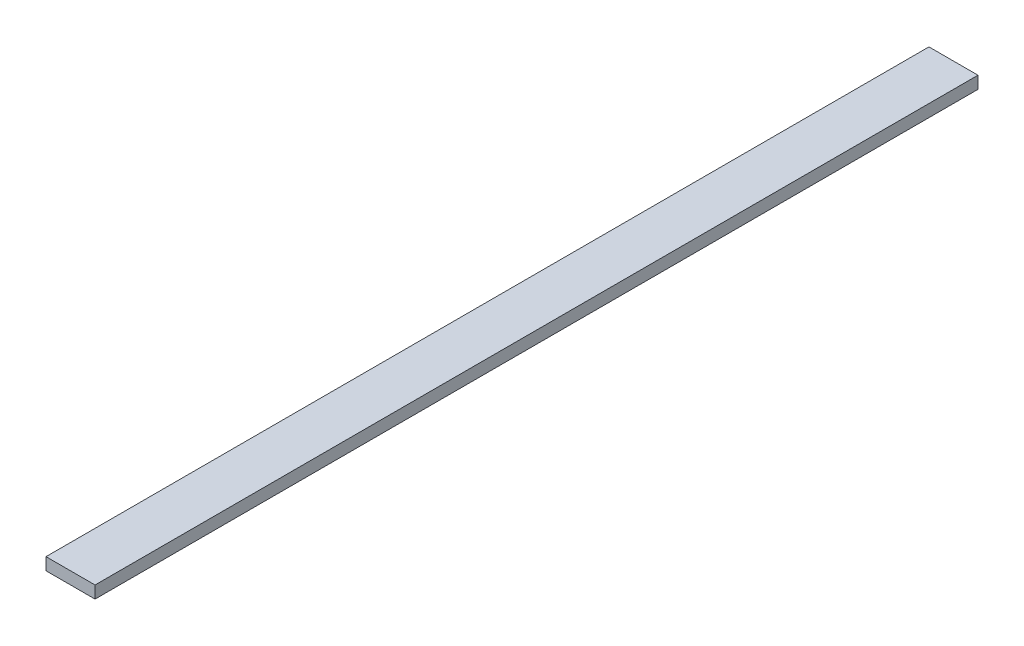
from build123d import *

# Parameters (mm, degrees)
SKETCH1_W           = 50.8
SKETCH1_H           = 12.7
BOSS_EXTRUDE1_DEPTH = 914.4


with BuildPart() as part:
    # Sketch1 → Boss-Extrude1 (new body)
    with BuildSketch(Plane.XY):
        Rectangle(SKETCH1_W, SKETCH1_H)
    extrude(amount=BOSS_EXTRUDE1_DEPTH)


solid = part.part
